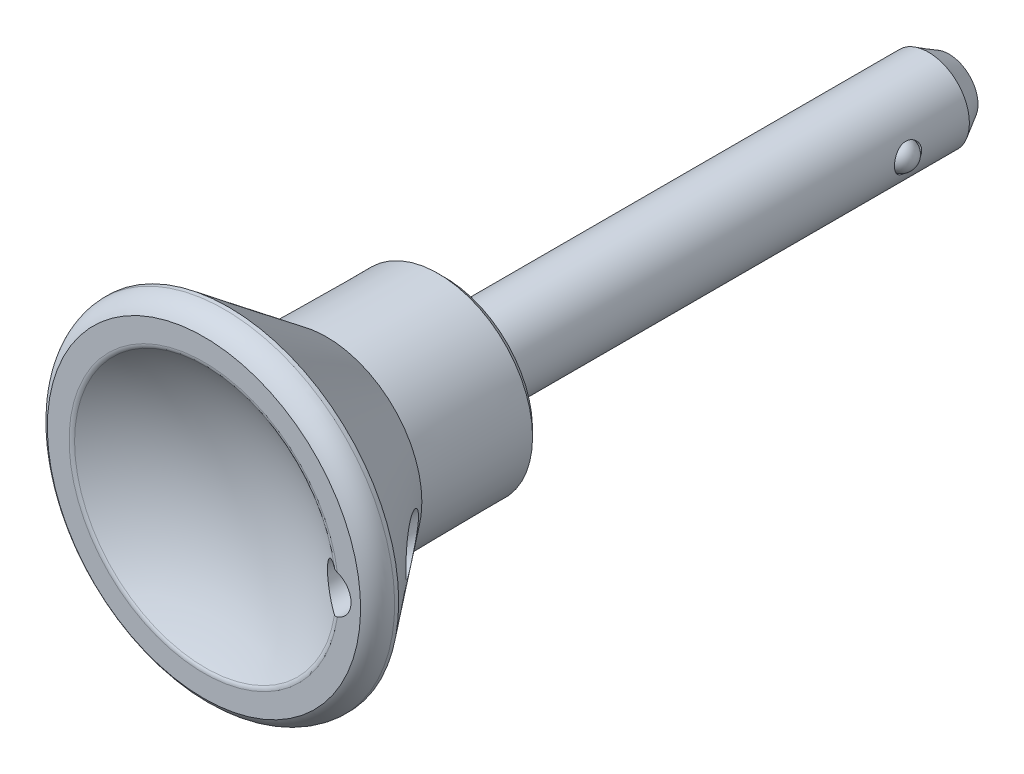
ISO-10303-21;
HEADER;
FILE_DESCRIPTION(('STEP AP214'),'2;1');
FILE_NAME('part.step','',(''),(''),'','','');
FILE_SCHEMA(('AUTOMOTIVE_DESIGN { 1 0 10303 214 1 1 1 1 }'));
ENDSEC;
DATA;
#1=APPLICATION_CONTEXT('core data for automotive mechanical design processes');
#2=APPLICATION_PROTOCOL_DEFINITION('international standard','automotive_design',2000,#1);
#3=PRODUCT_CONTEXT('',#1,'mechanical');
#4=PRODUCT('Part','Part','',(#3));
#5=PRODUCT_RELATED_PRODUCT_CATEGORY('part','',(#4));
#6=PRODUCT_DEFINITION_FORMATION('','',#4);
#7=PRODUCT_DEFINITION_CONTEXT('part definition',#1,'design');
#8=PRODUCT_DEFINITION('design','',#6,#7);
#9=PRODUCT_DEFINITION_SHAPE('','',#8);
#10=(LENGTH_UNIT() NAMED_UNIT(*) SI_UNIT(.MILLI.,.METRE.));
#11=(NAMED_UNIT(*) PLANE_ANGLE_UNIT() SI_UNIT($,.RADIAN.));
#12=(NAMED_UNIT(*) SI_UNIT($,.STERADIAN.) SOLID_ANGLE_UNIT());
#13=UNCERTAINTY_MEASURE_WITH_UNIT(LENGTH_MEASURE(1.E-05),#10,'distance_accuracy_value','');
#14=(GEOMETRIC_REPRESENTATION_CONTEXT(3) GLOBAL_UNCERTAINTY_ASSIGNED_CONTEXT((#13)) GLOBAL_UNIT_ASSIGNED_CONTEXT((#10,
#11,#12)) REPRESENTATION_CONTEXT('',''));
#15=CARTESIAN_POINT('',(0.,0.,0.));
#16=DIRECTION('',(0.,0.,1.));
#17=DIRECTION('',(1.,0.,0.));
#18=AXIS2_PLACEMENT_3D('',#15,#16,#17);
#19=CARTESIAN_POINT('',(0.,0.,0.));
#20=DIRECTION('',(0.,0.,1.));
#21=DIRECTION('',(0.,-1.,0.));
#22=AXIS2_PLACEMENT_3D('',#19,#20,#21);
#23=CYLINDRICAL_SURFACE('',#22,3.);
#24=CARTESIAN_POINT('',(0.,0.,0.));
#25=DIRECTION('',(0.,0.,1.));
#26=DIRECTION('',(0.,-1.,0.));
#27=AXIS2_PLACEMENT_3D('',#24,#25,#26);
#28=CIRCLE('',#27,3.);
#29=CARTESIAN_POINT('',(0.,-3.,0.));
#30=VERTEX_POINT('',#29);
#31=EDGE_CURVE('E18',#30,#30,#28,.T.);
#32=ORIENTED_EDGE('',*,*,#31,.F.);
#33=EDGE_LOOP('',(#32));
#34=FACE_BOUND('',#33,.T.);
#35=CARTESIAN_POINT('',(0.,0.,-35.5));
#36=DIRECTION('',(0.,0.,1.));
#37=DIRECTION('',(1.,0.,0.));
#38=AXIS2_PLACEMENT_3D('',#35,#36,#37);
#39=CIRCLE('',#38,3.);
#40=CARTESIAN_POINT('',(3.,0.,-35.5));
#41=VERTEX_POINT('',#40);
#42=EDGE_CURVE('E115',#41,#41,#39,.T.);
#43=ORIENTED_EDGE('',*,*,#42,.T.);
#44=EDGE_LOOP('',(#43));
#45=FACE_BOUND('',#44,.T.);
#46=CARTESIAN_POINT('',(3.,0.,-32.));
#47=CARTESIAN_POINT('',(2.99999782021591,-0.0544873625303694,-31.9999969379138));
#48=CARTESIAN_POINT('',(2.99849945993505,-0.109030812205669,-31.9955259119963));
#49=CARTESIAN_POINT('',(2.99265949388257,-0.216567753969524,-31.9777925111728));
#50=CARTESIAN_POINT('',(2.98831315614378,-0.269558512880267,-31.9645155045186));
#51=CARTESIAN_POINT('',(2.9772520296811,-0.372338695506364,-31.9296777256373));
#52=CARTESIAN_POINT('',(2.97054267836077,-0.422135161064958,-31.9081359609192));
#53=CARTESIAN_POINT('',(2.95544181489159,-0.517390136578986,-31.8574495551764));
#54=CARTESIAN_POINT('',(2.94705050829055,-0.562849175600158,-31.8283058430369));
#55=CARTESIAN_POINT('',(2.9291411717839,-0.649740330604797,-31.7621750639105));
#56=CARTESIAN_POINT('',(2.91959606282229,-0.691001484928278,-31.7249707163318));
#57=CARTESIAN_POINT('',(2.90060364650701,-0.766830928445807,-31.6442351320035));
#58=CARTESIAN_POINT('',(2.89115636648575,-0.80139739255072,-31.6007021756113));
#59=CARTESIAN_POINT('',(2.87313330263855,-0.863825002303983,-31.5070147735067));
#60=CARTESIAN_POINT('',(2.86459035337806,-0.891464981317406,-31.4567060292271));
#61=CARTESIAN_POINT('',(2.84975302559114,-0.937818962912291,-31.3518236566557));
#62=CARTESIAN_POINT('',(2.84345795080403,-0.956535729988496,-31.2972513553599));
#63=CARTESIAN_POINT('',(2.834113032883,-0.983873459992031,-31.187326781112));
#64=CARTESIAN_POINT('',(2.83096095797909,-0.992813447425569,-31.1320627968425));
#65=CARTESIAN_POINT('',(2.82795656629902,-1.00134112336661,-31.020736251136));
#66=CARTESIAN_POINT('',(2.82810323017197,-1.00093170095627,-30.9646739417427));
#67=CARTESIAN_POINT('',(2.83159014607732,-0.991019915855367,-30.8560634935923));
#68=CARTESIAN_POINT('',(2.83478414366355,-0.981933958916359,-30.8034718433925));
#69=CARTESIAN_POINT('',(2.84376655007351,-0.955606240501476,-30.7006068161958));
#70=CARTESIAN_POINT('',(2.84955528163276,-0.938363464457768,-30.650333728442));
#71=CARTESIAN_POINT('',(2.86317929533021,-0.895938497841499,-30.5525859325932));
#72=CARTESIAN_POINT('',(2.87104608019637,-0.870632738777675,-30.5051694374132));
#73=CARTESIAN_POINT('',(2.88792606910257,-0.812887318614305,-30.4151267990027));
#74=CARTESIAN_POINT('',(2.89693954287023,-0.780445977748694,-30.3725017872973));
#75=CARTESIAN_POINT('',(2.91567165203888,-0.707355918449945,-30.2909155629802));
#76=CARTESIAN_POINT('',(2.92540257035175,-0.666367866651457,-30.2522605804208));
#77=CARTESIAN_POINT('',(2.94406631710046,-0.578354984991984,-30.1822794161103));
#78=CARTESIAN_POINT('',(2.95299879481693,-0.531327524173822,-30.1509564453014));
#79=CARTESIAN_POINT('',(2.96917806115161,-0.431907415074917,-30.0962803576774));
#80=CARTESIAN_POINT('',(2.97640595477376,-0.37946312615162,-30.073015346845));
#81=CARTESIAN_POINT('',(2.98821351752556,-0.271163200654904,-30.0357719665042));
#82=CARTESIAN_POINT('',(2.99279860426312,-0.215314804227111,-30.0217745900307));
#83=CARTESIAN_POINT('',(2.99719039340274,-0.132457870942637,-30.0084544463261));
#84=CARTESIAN_POINT('',(2.99824082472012,-0.106081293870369,-30.0052879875));
#85=CARTESIAN_POINT('',(2.9996461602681,-0.0531409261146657,-30.0010600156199));
#86=CARTESIAN_POINT('',(3.00000106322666,-0.0265771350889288,-29.9999985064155));
#87=CARTESIAN_POINT('',(2.99999782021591,0.0544873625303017,-30.0000030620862));
#88=CARTESIAN_POINT('',(2.99849945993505,0.109030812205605,-30.0044740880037));
#89=CARTESIAN_POINT('',(2.99265949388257,0.216567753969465,-30.0222074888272));
#90=CARTESIAN_POINT('',(2.98831315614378,0.26955851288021,-30.0354844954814));
#91=CARTESIAN_POINT('',(2.9772520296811,0.372338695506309,-30.0703222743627));
#92=CARTESIAN_POINT('',(2.97054267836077,0.422135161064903,-30.0918640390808));
#93=CARTESIAN_POINT('',(2.95544181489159,0.517390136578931,-30.1425504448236));
#94=CARTESIAN_POINT('',(2.94705050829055,0.562849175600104,-30.1716941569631));
#95=CARTESIAN_POINT('',(2.9291411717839,0.649740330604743,-30.2378249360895));
#96=CARTESIAN_POINT('',(2.91959606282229,0.691001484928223,-30.2750292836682));
#97=CARTESIAN_POINT('',(2.90060364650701,0.766830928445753,-30.3557648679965));
#98=CARTESIAN_POINT('',(2.89115636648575,0.801397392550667,-30.3992978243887));
#99=CARTESIAN_POINT('',(2.87313330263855,0.86382500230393,-30.4929852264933));
#100=CARTESIAN_POINT('',(2.86459035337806,0.891464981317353,-30.5432939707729));
#101=CARTESIAN_POINT('',(2.84975302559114,0.937818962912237,-30.6481763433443));
#102=CARTESIAN_POINT('',(2.84345795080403,0.956535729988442,-30.7027486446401));
#103=CARTESIAN_POINT('',(2.834113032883,0.983873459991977,-30.812673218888));
#104=CARTESIAN_POINT('',(2.83096095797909,0.992813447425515,-30.8679372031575));
#105=CARTESIAN_POINT('',(2.82795656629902,1.00134112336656,-30.979263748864));
#106=CARTESIAN_POINT('',(2.82810323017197,1.00093170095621,-31.0353260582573));
#107=CARTESIAN_POINT('',(2.83159014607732,0.991019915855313,-31.1439365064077));
#108=CARTESIAN_POINT('',(2.83478414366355,0.981933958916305,-31.1965281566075));
#109=CARTESIAN_POINT('',(2.84376655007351,0.955606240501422,-31.2993931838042));
#110=CARTESIAN_POINT('',(2.84955528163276,0.938363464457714,-31.349666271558));
#111=CARTESIAN_POINT('',(2.86317929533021,0.895938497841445,-31.4474140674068));
#112=CARTESIAN_POINT('',(2.87104608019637,0.870632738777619,-31.4948305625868));
#113=CARTESIAN_POINT('',(2.88792606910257,0.81288731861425,-31.5848732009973));
#114=CARTESIAN_POINT('',(2.89693954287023,0.780445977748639,-31.6274982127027));
#115=CARTESIAN_POINT('',(2.91567165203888,0.70735591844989,-31.7090844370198));
#116=CARTESIAN_POINT('',(2.92540257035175,0.6663678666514,-31.7477394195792));
#117=CARTESIAN_POINT('',(2.94406631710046,0.578354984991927,-31.8177205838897));
#118=CARTESIAN_POINT('',(2.95299879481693,0.531327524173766,-31.8490435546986));
#119=CARTESIAN_POINT('',(2.96917806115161,0.431907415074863,-31.9037196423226));
#120=CARTESIAN_POINT('',(2.97640595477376,0.379463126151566,-31.926984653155));
#121=CARTESIAN_POINT('',(2.98821351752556,0.27116320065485,-31.9642280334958));
#122=CARTESIAN_POINT('',(2.99279860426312,0.215314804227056,-31.9782254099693));
#123=CARTESIAN_POINT('',(2.99719039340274,0.132457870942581,-31.9915455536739));
#124=CARTESIAN_POINT('',(2.99824082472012,0.10608129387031,-31.9947120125));
#125=CARTESIAN_POINT('',(2.9996461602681,0.0531409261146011,-31.9989399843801));
#126=CARTESIAN_POINT('',(3.00000106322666,0.0265771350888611,-32.0000014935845));
#127=CARTESIAN_POINT('',(3.,0.,-32.));
#128=B_SPLINE_CURVE_WITH_KNOTS('',3,(#46,#47,#48,#49,#50,#51,#52,#53,#54,#55,#56,#57,#58,#59,
#60,#61,#62,#63,#64,#65,#66,#67,#68,#69,#70,#71,#72,#73,#74,#75,#76,#77,#78,#79,#80,#81,#82,#83,
#84,#85,#86,#87,#88,#89,#90,#91,#92,#93,#94,#95,#96,#97,#98,#99,#100,#101,#102,#103,#104,#105,
#106,#107,#108,#109,#110,#111,#112,#113,#114,#115,#116,#117,#118,#119,#120,#121,#122,#123,#124,
#125,#126,#127),.UNSPECIFIED.,.T.,.F.,(4,2,2,2,2,2,2,2,2,2,2,2,2,2,2,2,2,2,2,2,2,2,2,2,2,2,2,2,
2,2,2,2,2,2,2,2,2,2,2,2,4),(0.,0.163359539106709,0.326991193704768,0.490248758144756,
0.653486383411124,0.821842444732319,0.990244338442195,1.16348424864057,1.3366704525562,
1.50401925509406,1.67131634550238,1.83096789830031,1.99063931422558,2.15288605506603,
2.31517103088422,2.4859039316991,2.6567114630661,2.82933165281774,3.00159671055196,
3.08127795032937,3.16095933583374,3.32431887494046,3.48795052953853,3.65120809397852,
3.81444571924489,3.98280178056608,4.15120367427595,4.32444358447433,4.49762978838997,
4.66497859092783,4.83227568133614,4.99192723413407,5.15159865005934,5.3138453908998,
5.47613036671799,5.64686326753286,5.81767079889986,5.9902909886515,6.16255604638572,
6.24223728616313,6.32191867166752),.UNSPECIFIED.);
#129=CARTESIAN_POINT('',(3.,0.,-32.));
#130=VERTEX_POINT('',#129);
#131=EDGE_CURVE('E159',#130,#130,#128,.T.);
#132=ORIENTED_EDGE('',*,*,#131,.T.);
#133=EDGE_LOOP('',(#132));
#134=FACE_BOUND('',#133,.T.);
#135=ADVANCED_FACE('F15',(#34,#45,#134),#23,.T.);
#136=CARTESIAN_POINT('',(6.4240762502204,-6.50116727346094,0.));
#137=DIRECTION('',(0.,0.,-1.));
#138=DIRECTION('',(-1.,0.,0.));
#139=AXIS2_PLACEMENT_3D('',#136,#137,#138);
#140=PLANE('',#139);
#141=ORIENTED_EDGE('',*,*,#31,.T.);
#142=EDGE_LOOP('',(#141));
#143=FACE_BOUND('',#142,.T.);
#144=CARTESIAN_POINT('',(0.,0.,0.));
#145=DIRECTION('',(0.,0.,1.));
#146=DIRECTION('',(0.,-1.,0.));
#147=AXIS2_PLACEMENT_3D('',#144,#145,#146);
#148=CIRCLE('',#147,6.4240762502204);
#149=CARTESIAN_POINT('',(0.,-6.4240762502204,0.));
#150=VERTEX_POINT('',#149);
#151=EDGE_CURVE('E103',#150,#150,#148,.T.);
#152=ORIENTED_EDGE('',*,*,#151,.F.);
#153=EDGE_LOOP('',(#152));
#154=FACE_BOUND('',#153,.T.);
#155=ADVANCED_FACE('F184',(#143,#154),#140,.T.);
#156=CARTESIAN_POINT('',(0.,0.,0.));
#157=DIRECTION('',(0.,0.,1.));
#158=DIRECTION('',(0.,-1.,0.));
#159=AXIS2_PLACEMENT_3D('',#156,#157,#158);
#160=CONICAL_SURFACE('',#159,6.4240762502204,0.789761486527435);
#161=CARTESIAN_POINT('',(0.,0.,0.499980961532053));
#162=DIRECTION('',(0.,0.,-1.));
#163=DIRECTION('',(1.,0.,0.));
#164=AXIS2_PLACEMENT_3D('',#161,#162,#163);
#165=CIRCLE('',#164,6.92843951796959);
#166=CARTESIAN_POINT('',(6.92843951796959,0.,0.499980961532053));
#167=VERTEX_POINT('',#166);
#168=EDGE_CURVE('E134',#167,#167,#165,.F.);
#169=ORIENTED_EDGE('',*,*,#168,.F.);
#170=EDGE_LOOP('',(#169));
#171=FACE_BOUND('',#170,.T.);
#172=ORIENTED_EDGE('',*,*,#151,.T.);
#173=EDGE_LOOP('',(#172));
#174=FACE_BOUND('',#173,.T.);
#175=ADVANCED_FACE('F189',(#171,#174),#160,.T.);
#176=CARTESIAN_POINT('',(0.,0.,0.499980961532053));
#177=DIRECTION('',(0.,0.,1.));
#178=DIRECTION('',(0.,-1.,0.));
#179=AXIS2_PLACEMENT_3D('',#176,#177,#178);
#180=CONICAL_SURFACE('',#179,6.92843951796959,0.00872664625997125);
#181=CARTESIAN_POINT('',(0.,0.,8.7));
#182=DIRECTION('',(0.,0.,-1.));
#183=DIRECTION('',(1.,0.,0.));
#184=AXIS2_PLACEMENT_3D('',#181,#182,#183);
#185=CIRCLE('',#184,7.);
#186=CARTESIAN_POINT('',(7.,0.,8.7));
#187=VERTEX_POINT('',#186);
#188=EDGE_CURVE('E129',#187,#187,#185,.F.);
#189=ORIENTED_EDGE('',*,*,#188,.F.);
#190=EDGE_LOOP('',(#189));
#191=FACE_BOUND('',#190,.T.);
#192=ORIENTED_EDGE('',*,*,#168,.T.);
#193=EDGE_LOOP('',(#192));
#194=FACE_BOUND('',#193,.T.);
#195=ADVANCED_FACE('F201',(#191,#194),#180,.T.);
#196=CARTESIAN_POINT('',(0.,0.,16.2));
#197=DIRECTION('',(0.,0.,1.));
#198=DIRECTION('',(0.,-1.,0.));
#199=AXIS2_PLACEMENT_3D('',#196,#197,#198);
#200=CYLINDRICAL_SURFACE('',#199,12.5);
#201=CARTESIAN_POINT('',(0.,0.,15.9));
#202=DIRECTION('',(0.,0.,-1.));
#203=DIRECTION('',(1.,0.,0.));
#204=AXIS2_PLACEMENT_3D('',#201,#202,#203);
#205=CIRCLE('',#204,12.5);
#206=CARTESIAN_POINT('',(12.5,0.,15.9));
#207=VERTEX_POINT('',#206);
#208=EDGE_CURVE('E130',#207,#207,#205,.T.);
#209=ORIENTED_EDGE('',*,*,#208,.F.);
#210=EDGE_LOOP('',(#209));
#211=FACE_BOUND('',#210,.T.);
#212=CARTESIAN_POINT('',(0.,0.,16.2));
#213=DIRECTION('',(0.,0.,1.));
#214=DIRECTION('',(0.,-1.,0.));
#215=AXIS2_PLACEMENT_3D('',#212,#213,#214);
#216=CIRCLE('',#215,12.5);
#217=CARTESIAN_POINT('',(0.,-12.5,16.2));
#218=VERTEX_POINT('',#217);
#219=EDGE_CURVE('E102',#218,#218,#216,.T.);
#220=ORIENTED_EDGE('',*,*,#219,.F.);
#221=EDGE_LOOP('',(#220));
#222=FACE_BOUND('',#221,.T.);
#223=ADVANCED_FACE('F208',(#211,#222),#200,.T.);
#224=CARTESIAN_POINT('',(0.,0.,8.7));
#225=DIRECTION('',(0.,0.,1.));
#226=DIRECTION('',(0.,-1.,0.));
#227=AXIS2_PLACEMENT_3D('',#224,#225,#226);
#228=CONICAL_SURFACE('',#227,7.,0.65233090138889);
#229=CARTESIAN_POINT('',(9.05806451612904,-1.4803605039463,11.5515077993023));
#230=CARTESIAN_POINT('',(8.99141512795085,-1.46946825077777,11.4631001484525));
#231=CARTESIAN_POINT('',(8.92550148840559,-1.45408557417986,11.3746905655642));
#232=CARTESIAN_POINT('',(8.7955636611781,-1.41427171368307,11.1984472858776));
#233=CARTESIAN_POINT('',(8.73154031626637,-1.38983655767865,11.1106138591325));
#234=CARTESIAN_POINT('',(8.60623315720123,-1.33170423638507,10.936758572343));
#235=CARTESIAN_POINT('',(8.54493725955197,-1.29805393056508,10.8507298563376));
#236=CARTESIAN_POINT('',(8.42544336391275,-1.22074353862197,10.6811358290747));
#237=CARTESIAN_POINT('',(8.36724184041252,-1.17709515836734,10.5975677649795));
#238=CARTESIAN_POINT('',(8.26922940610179,-1.09114708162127,10.4552980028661));
#239=CARTESIAN_POINT('',(8.22852162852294,-1.05135683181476,10.3957022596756));
#240=CARTESIAN_POINT('',(8.14989980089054,-0.964725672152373,10.2796936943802));
#241=CARTESIAN_POINT('',(8.11198828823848,-0.917878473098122,10.2232837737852));
#242=CARTESIAN_POINT('',(8.03963417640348,-0.815744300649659,10.1148327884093));
#243=CARTESIAN_POINT('',(8.00522654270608,-0.760383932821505,10.0628364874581));
#244=CARTESIAN_POINT('',(7.94192848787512,-0.640477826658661,9.96655825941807));
#245=CARTESIAN_POINT('',(7.91302454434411,-0.575955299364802,9.92225744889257));
#246=CARTESIAN_POINT('',(7.87251252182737,-0.463057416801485,9.85986137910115));
#247=CARTESIAN_POINT('',(7.85846623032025,-0.417573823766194,9.8381417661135));
#248=CARTESIAN_POINT('',(7.83441768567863,-0.3231529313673,9.80086955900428));
#249=CARTESIAN_POINT('',(7.82440740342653,-0.274222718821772,9.78530472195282));
#250=CARTESIAN_POINT('',(7.81132335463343,-0.187620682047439,9.76493500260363));
#251=CARTESIAN_POINT('',(7.80710048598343,-0.15053785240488,9.7583503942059));
#252=CARTESIAN_POINT('',(7.80143783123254,-0.0756412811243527,9.74951765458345));
#253=CARTESIAN_POINT('',(7.79999798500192,-0.0378275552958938,9.74726942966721));
#254=CARTESIAN_POINT('',(7.8000025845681,0.0485200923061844,9.74727695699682));
#255=CARTESIAN_POINT('',(7.80237736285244,0.0970629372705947,9.75098545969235));
#256=CARTESIAN_POINT('',(7.81164444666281,0.192651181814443,9.76543406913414));
#257=CARTESIAN_POINT('',(7.81854204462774,0.239694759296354,9.77618241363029));
#258=CARTESIAN_POINT('',(7.83829683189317,0.341610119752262,9.80688772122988));
#259=CARTESIAN_POINT('',(7.85215507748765,0.395817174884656,9.82838678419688));
#260=CARTESIAN_POINT('',(7.8845198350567,0.499375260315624,9.87838349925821));
#261=CARTESIAN_POINT('',(7.90303499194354,0.548717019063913,9.9068941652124));
#262=CARTESIAN_POINT('',(7.95423062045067,0.667068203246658,9.98533549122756));
#263=CARTESIAN_POINT('',(7.98924354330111,0.732796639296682,10.0386516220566));
#264=CARTESIAN_POINT('',(8.06472209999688,0.853932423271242,10.1525776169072));
#265=CARTESIAN_POINT('',(8.10520064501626,0.909314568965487,10.2132047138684));
#266=CARTESIAN_POINT('',(8.18383548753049,1.00367842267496,10.3298982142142));
#267=CARTESIAN_POINT('',(8.22147534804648,1.04387385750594,10.3853483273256));
#268=CARTESIAN_POINT('',(8.29898008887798,1.1184153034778,10.4986148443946));
#269=CARTESIAN_POINT('',(8.33884646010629,1.15275733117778,10.556432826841));
#270=CARTESIAN_POINT('',(8.42042546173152,1.21614962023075,10.6737908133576));
#271=CARTESIAN_POINT('',(8.46214099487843,1.24519116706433,10.7333334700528));
#272=CARTESIAN_POINT('',(8.54706483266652,1.29830522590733,10.8535675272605));
#273=CARTESIAN_POINT('',(8.59027353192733,1.32237641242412,10.9142592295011));
#274=CARTESIAN_POINT('',(8.69675324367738,1.37513054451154,11.0626135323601));
#275=CARTESIAN_POINT('',(8.7606819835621,1.40136483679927,11.150681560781));
#276=CARTESIAN_POINT('',(8.89058399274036,1.44466814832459,11.3275915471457));
#277=CARTESIAN_POINT('',(8.95655819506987,1.46173291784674,11.4164338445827));
#278=CARTESIAN_POINT('',(9.09008194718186,1.48679092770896,11.5942301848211));
#279=CARTESIAN_POINT('',(9.15763151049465,1.49478409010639,11.683184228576));
#280=CARTESIAN_POINT('',(9.293788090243,1.50153429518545,11.8605390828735));
#281=CARTESIAN_POINT('',(9.36239469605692,1.50029483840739,11.9489400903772));
#282=CARTESIAN_POINT('',(9.53896432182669,1.48478544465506,12.1740527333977));
#283=CARTESIAN_POINT('',(9.64741582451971,1.46359594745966,12.3100469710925));
#284=CARTESIAN_POINT('',(9.80896256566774,1.41213790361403,12.5095339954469));
#285=CARTESIAN_POINT('',(9.86259038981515,1.39172486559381,12.5752398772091));
#286=CARTESIAN_POINT('',(9.96902195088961,1.34380635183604,12.7046889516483));
#287=CARTESIAN_POINT('',(10.021826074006,1.31630431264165,12.7684330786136));
#288=CARTESIAN_POINT('',(10.1398540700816,1.24522266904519,12.9099256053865));
#289=CARTESIAN_POINT('',(10.2046458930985,1.1993124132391,12.9868895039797));
#290=CARTESIAN_POINT('',(10.3299573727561,1.09357010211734,13.1345591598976));
#291=CARTESIAN_POINT('',(10.3904821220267,1.03375502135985,13.2052724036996));
#292=CARTESIAN_POINT('',(10.4895745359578,0.916081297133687,13.3202576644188));
#293=CARTESIAN_POINT('',(10.5297805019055,0.861692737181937,13.3666468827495));
#294=CARTESIAN_POINT('',(10.6043536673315,0.743973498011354,13.452316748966));
#295=CARTESIAN_POINT('',(10.6387288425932,0.680655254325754,13.4916071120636));
#296=CARTESIAN_POINT('',(10.6925693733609,0.560424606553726,13.5529446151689));
#297=CARTESIAN_POINT('',(10.7136506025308,0.505208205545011,13.5768833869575));
#298=CARTESIAN_POINT('',(10.7495749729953,0.39030246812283,13.6176027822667));
#299=CARTESIAN_POINT('',(10.7644289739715,0.330621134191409,13.6343958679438));
#300=CARTESIAN_POINT('',(10.7836092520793,0.225596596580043,13.656059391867));
#301=CARTESIAN_POINT('',(10.7897268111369,0.180990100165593,13.6629607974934));
#302=CARTESIAN_POINT('',(10.7979243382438,0.0909301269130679,13.6722061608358));
#303=CARTESIAN_POINT('',(10.8000037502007,0.0454765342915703,13.6745494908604));
#304=CARTESIAN_POINT('',(10.799994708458,-0.0641674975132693,13.6745397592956));
#305=CARTESIAN_POINT('',(10.795841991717,-0.128380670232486,13.6698606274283));
#306=CARTESIAN_POINT('',(10.7796239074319,-0.254506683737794,13.6515601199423));
#307=CARTESIAN_POINT('',(10.7675483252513,-0.316416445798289,13.6379272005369));
#308=CARTESIAN_POINT('',(10.7366563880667,-0.435644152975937,13.6029693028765));
#309=CARTESIAN_POINT('',(10.7178919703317,-0.492993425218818,13.5817035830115));
#310=CARTESIAN_POINT('',(10.6748799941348,-0.602645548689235,13.532811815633));
#311=CARTESIAN_POINT('',(10.6506301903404,-0.654946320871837,13.5051831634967));
#312=CARTESIAN_POINT('',(10.5859735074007,-0.77647271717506,13.4312530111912));
#313=CARTESIAN_POINT('',(10.5432056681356,-0.842728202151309,13.3821425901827));
#314=CARTESIAN_POINT('',(10.4516580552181,-0.964099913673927,13.2763616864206));
#315=CARTESIAN_POINT('',(10.4028645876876,-1.01918998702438,13.2196739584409));
#316=CARTESIAN_POINT('',(10.2766029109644,-1.14345503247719,13.0719673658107));
#317=CARTESIAN_POINT('',(10.1967753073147,-1.20635475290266,12.9777102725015));
#318=CARTESIAN_POINT('',(10.0329696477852,-1.31236147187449,12.7820645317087));
#319=CARTESIAN_POINT('',(9.94898466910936,-1.35543413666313,12.6806638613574));
#320=CARTESIAN_POINT('',(9.79718248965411,-1.41705079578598,12.4951419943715));
#321=CARTESIAN_POINT('',(9.72964852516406,-1.43883766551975,12.4118303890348));
#322=CARTESIAN_POINT('',(9.59439459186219,-1.47247845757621,12.2433068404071));
#323=CARTESIAN_POINT('',(9.52667453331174,-1.48432617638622,12.1580937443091));
#324=CARTESIAN_POINT('',(9.39151350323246,-1.49875216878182,11.9862568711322));
#325=CARTESIAN_POINT('',(9.32407407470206,-1.50130123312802,11.8996295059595));
#326=CARTESIAN_POINT('',(9.19020636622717,-1.49747387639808,11.725837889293));
#327=CARTESIAN_POINT('',(9.12377782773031,-1.49109977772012,11.6386737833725));
#328=CARTESIAN_POINT('',(9.05806451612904,-1.4803605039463,11.5515077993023));
#329=B_SPLINE_CURVE_WITH_KNOTS('',3,(#229,#230,#231,#232,#233,#234,#235,#236,#237,#238,#239,
#240,#241,#242,#243,#244,#245,#246,#247,#248,#249,#250,#251,#252,#253,#254,#255,#256,#257,#258,
#259,#260,#261,#262,#263,#264,#265,#266,#267,#268,#269,#270,#271,#272,#273,#274,#275,#276,#277,
#278,#279,#280,#281,#282,#283,#284,#285,#286,#287,#288,#289,#290,#291,#292,#293,#294,#295,#296,
#297,#298,#299,#300,#301,#302,#303,#304,#305,#306,#307,#308,#309,#310,#311,#312,#313,#314,#315,
#316,#317,#318,#319,#320,#321,#322,#323,#324,#325,#326,#327,#328),.UNSPECIFIED.,.T.,.F.,(4,2,2,
2,2,2,2,2,2,2,2,2,2,2,2,2,2,2,2,2,2,2,2,2,2,2,2,2,2,2,2,2,2,2,2,2,2,2,2,2,2,2,2,2,2,2,2,2,2,4),
(0.,0.333658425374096,0.667463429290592,0.999601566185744,1.33135280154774,1.57826788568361,
1.82540433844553,2.07480511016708,2.32358497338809,2.48005639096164,2.63621497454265,
2.74958301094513,2.86294859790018,3.00835870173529,3.15393926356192,3.33275537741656,
3.51190592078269,3.78514778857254,4.05904679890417,4.2931693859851,4.52745067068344,
4.76211373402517,4.9968392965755,5.33221840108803,5.66775280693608,6.0032900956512,
6.33870017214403,6.86226215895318,7.12372139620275,7.38505412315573,7.71589293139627,
8.04632996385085,8.29159071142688,8.53651321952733,8.72709088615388,8.91733480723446,
9.0535973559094,9.18987866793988,9.3821719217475,9.57471358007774,9.76579164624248,
9.95694806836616,10.2340958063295,10.5118854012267,10.9254412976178,11.3397106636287,
11.6675345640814,11.995562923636,12.3246208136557,12.6535930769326),.UNSPECIFIED.);
#330=CARTESIAN_POINT('',(9.05806451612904,-1.4803605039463,11.5515077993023));
#331=VERTEX_POINT('',#330);
#332=EDGE_CURVE('E52',#331,#331,#329,.T.);
#333=ORIENTED_EDGE('',*,*,#332,.F.);
#334=EDGE_LOOP('',(#333));
#335=FACE_BOUND('',#334,.T.);
#336=ORIENTED_EDGE('',*,*,#208,.T.);
#337=EDGE_LOOP('',(#336));
#338=FACE_BOUND('',#337,.T.);
#339=ORIENTED_EDGE('',*,*,#188,.T.);
#340=EDGE_LOOP('',(#339));
#341=FACE_BOUND('',#340,.T.);
#342=ADVANCED_FACE('F211',(#335,#338,#341),#228,.T.);
#343=CARTESIAN_POINT('',(0.,0.,15.9596620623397));
#344=DIRECTION('',(0.,0.,1.));
#345=DIRECTION('',(0.,-1.,0.));
#346=AXIS2_PLACEMENT_3D('',#343,#344,#345);
#347=TOROIDAL_SURFACE('',#346,10.5144930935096,2.);
#348=ORIENTED_EDGE('',*,*,#219,.T.);
#349=EDGE_LOOP('',(#348));
#350=FACE_BOUND('',#349,.T.);
#351=CARTESIAN_POINT('',(0.,0.,17.7));
#352=DIRECTION('',(0.,0.,1.));
#353=DIRECTION('',(0.,-1.,0.));
#354=AXIS2_PLACEMENT_3D('',#351,#352,#353);
#355=CIRCLE('',#354,11.5);
#356=CARTESIAN_POINT('',(0.,-11.5,17.7));
#357=VERTEX_POINT('',#356);
#358=EDGE_CURVE('E57',#357,#357,#355,.T.);
#359=ORIENTED_EDGE('',*,*,#358,.F.);
#360=EDGE_LOOP('',(#359));
#361=FACE_BOUND('',#360,.T.);
#362=ADVANCED_FACE('F86',(#350,#361),#347,.T.);
#363=CARTESIAN_POINT('',(9.3,0.,9.7468824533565));
#364=DIRECTION('',(0.,0.,1.));
#365=DIRECTION('',(0.,-1.,0.));
#366=AXIS2_PLACEMENT_3D('',#363,#364,#365);
#367=CYLINDRICAL_SURFACE('',#366,1.5);
#368=ORIENTED_EDGE('',*,*,#332,.T.);
#369=EDGE_LOOP('',(#368));
#370=FACE_BOUND('',#369,.T.);
#371=CARTESIAN_POINT('',(9.79838709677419,-1.41478277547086,17.7));
#372=CARTESIAN_POINT('',(9.76967463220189,-1.42493393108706,17.7000278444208));
#373=CARTESIAN_POINT('',(9.74057958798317,-1.43416331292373,17.6978154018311));
#374=CARTESIAN_POINT('',(9.68339626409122,-1.45046247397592,17.688811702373));
#375=CARTESIAN_POINT('',(9.65530246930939,-1.45758512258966,17.6821493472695));
#376=CARTESIAN_POINT('',(9.60265119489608,-1.46937623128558,17.6649718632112));
#377=CARTESIAN_POINT('',(9.5780018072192,-1.47420693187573,17.6548534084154));
#378=CARTESIAN_POINT('',(9.52973678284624,-1.48251466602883,17.6305344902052));
#379=CARTESIAN_POINT('',(9.50616459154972,-1.48595330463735,17.6162348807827));
#380=CARTESIAN_POINT('',(9.48387096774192,-1.48868783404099,17.6));
#381=B_SPLINE_CURVE_WITH_KNOTS('',3,(#371,#372,#373,#374,#375,#376,#377,#378,#379,#380),
.UNSPECIFIED.,.F.,.F.,(4,2,2,2,4),(0.,0.0913475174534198,0.180157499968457,0.261045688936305,
0.344033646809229),.UNSPECIFIED.);
#382=CARTESIAN_POINT('',(9.79838709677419,-1.41478277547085,17.7));
#383=VERTEX_POINT('',#382);
#384=CARTESIAN_POINT('',(9.48387096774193,-1.48868783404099,17.6));
#385=VERTEX_POINT('',#384);
#386=EDGE_CURVE('E44',#383,#385,#381,.T.);
#387=ORIENTED_EDGE('',*,*,#386,.F.);
#388=CARTESIAN_POINT('',(9.3,0.,17.7));
#389=DIRECTION('',(0.,0.,1.));
#390=DIRECTION('',(0.,-1.,0.));
#391=AXIS2_PLACEMENT_3D('',#388,#389,#390);
#392=CIRCLE('',#391,1.5);
#393=CARTESIAN_POINT('',(9.79838709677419,1.41478277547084,17.7));
#394=VERTEX_POINT('',#393);
#395=EDGE_CURVE('E32',#394,#383,#392,.F.);
#396=ORIENTED_EDGE('',*,*,#395,.F.);
#397=CARTESIAN_POINT('',(9.79838709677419,1.41478277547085,17.7));
#398=CARTESIAN_POINT('',(9.76967463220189,1.42493393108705,17.7000278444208));
#399=CARTESIAN_POINT('',(9.74057958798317,1.43416331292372,17.6978154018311));
#400=CARTESIAN_POINT('',(9.68339626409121,1.45046247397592,17.688811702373));
#401=CARTESIAN_POINT('',(9.65530246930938,1.45758512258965,17.6821493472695));
#402=CARTESIAN_POINT('',(9.60265119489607,1.46937623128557,17.6649718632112));
#403=CARTESIAN_POINT('',(9.5780018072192,1.47420693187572,17.6548534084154));
#404=CARTESIAN_POINT('',(9.52973678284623,1.48251466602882,17.6305344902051));
#405=CARTESIAN_POINT('',(9.50616459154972,1.48595330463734,17.6162348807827));
#406=CARTESIAN_POINT('',(9.48387096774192,1.48868783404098,17.6));
#407=B_SPLINE_CURVE_WITH_KNOTS('',3,(#397,#398,#399,#400,#401,#402,#403,#404,#405,#406),
.UNSPECIFIED.,.F.,.F.,(4,2,2,2,4),(0.,0.0913475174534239,0.180157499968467,0.261045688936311,
0.34403364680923),.UNSPECIFIED.);
#408=CARTESIAN_POINT('',(9.48387096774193,1.48868783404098,17.6));
#409=VERTEX_POINT('',#408);
#410=EDGE_CURVE('E45',#394,#409,#407,.T.);
#411=ORIENTED_EDGE('',*,*,#410,.T.);
#412=CARTESIAN_POINT('',(9.48387096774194,-1.48868783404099,17.6));
#413=CARTESIAN_POINT('',(9.38181447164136,-1.5012604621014,17.5258231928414));
#414=CARTESIAN_POINT('',(9.27847034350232,-1.50339409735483,17.4514075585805));
#415=CARTESIAN_POINT('',(9.07150168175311,-1.48616897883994,17.3036113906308));
#416=CARTESIAN_POINT('',(8.96788247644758,-1.46662385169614,17.230245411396));
#417=CARTESIAN_POINT('',(8.76570217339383,-1.40554015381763,17.0882393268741));
#418=CARTESIAN_POINT('',(8.66709675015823,-1.36425592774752,17.0195547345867));
#419=CARTESIAN_POINT('',(8.47807170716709,-1.25938003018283,16.8888158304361));
#420=CARTESIAN_POINT('',(8.38761877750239,-1.19588484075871,16.8267343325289));
#421=CARTESIAN_POINT('',(8.24568836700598,-1.0697955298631,16.7298945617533));
#422=CARTESIAN_POINT('',(8.19079097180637,-1.01295594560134,16.692612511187));
#423=CARTESIAN_POINT('',(8.08925811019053,-0.889102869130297,16.6238983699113));
#424=CARTESIAN_POINT('',(8.04262373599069,-0.822088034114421,16.5924670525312));
#425=CARTESIAN_POINT('',(7.95961243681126,-0.678453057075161,16.5366671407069));
#426=CARTESIAN_POINT('',(7.9233211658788,-0.601759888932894,16.5123574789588));
#427=CARTESIAN_POINT('',(7.86387797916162,-0.441385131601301,16.4726071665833));
#428=CARTESIAN_POINT('',(7.84069382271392,-0.357721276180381,16.4571447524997));
#429=CARTESIAN_POINT('',(7.81665644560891,-0.227526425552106,16.4411240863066));
#430=CARTESIAN_POINT('',(7.81042627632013,-0.182354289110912,16.4369745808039));
#431=CARTESIAN_POINT('',(7.80209606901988,-0.0914654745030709,16.4314273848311));
#432=CARTESIAN_POINT('',(7.79999581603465,-0.0457488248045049,16.4300295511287));
#433=CARTESIAN_POINT('',(7.8000067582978,0.0738974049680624,16.4300365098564));
#434=CARTESIAN_POINT('',(7.80550430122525,0.147878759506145,16.4336949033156));
#435=CARTESIAN_POINT('',(7.82172596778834,0.257047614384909,16.4445026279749));
#436=CARTESIAN_POINT('',(7.82847272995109,0.293170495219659,16.4489987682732));
#437=CARTESIAN_POINT('',(7.84452794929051,0.364609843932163,16.4597055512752));
#438=CARTESIAN_POINT('',(7.85383787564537,0.399925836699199,16.4659171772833));
#439=CARTESIAN_POINT('',(7.88533418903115,0.503926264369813,16.4869492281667));
#440=CARTESIAN_POINT('',(7.91114789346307,0.571060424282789,16.5042071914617));
#441=CARTESIAN_POINT('',(7.97122958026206,0.699580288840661,16.5444764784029));
#442=CARTESIAN_POINT('',(8.00550445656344,0.760961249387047,16.5674924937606));
#443=CARTESIAN_POINT('',(8.06330229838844,0.849663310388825,16.6064232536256));
#444=CARTESIAN_POINT('',(8.08431449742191,0.879441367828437,16.6205962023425));
#445=CARTESIAN_POINT('',(8.12808579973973,0.936974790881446,16.6501700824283));
#446=CARTESIAN_POINT('',(8.15084283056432,0.964732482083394,16.6655695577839));
#447=CARTESIAN_POINT('',(8.22150377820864,1.04495101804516,16.7134720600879));
#448=CARTESIAN_POINT('',(8.27178709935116,1.09434151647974,16.7476721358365));
#449=CARTESIAN_POINT('',(8.38550726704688,1.19170689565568,16.8253434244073));
#450=CARTESIAN_POINT('',(8.44976642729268,1.2382209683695,16.8694253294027));
#451=CARTESIAN_POINT('',(8.58287694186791,1.31978473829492,16.961227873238));
#452=CARTESIAN_POINT('',(8.65173257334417,1.3548235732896,17.0089519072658));
#453=CARTESIAN_POINT('',(8.76337185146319,1.40144242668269,17.0867690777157));
#454=CARTESIAN_POINT('',(8.80522580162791,1.41674274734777,17.1160369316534));
#455=CARTESIAN_POINT('',(8.88962205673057,1.44344948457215,17.1752539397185));
#456=CARTESIAN_POINT('',(8.93216367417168,1.45485956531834,17.2052024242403));
#457=CARTESIAN_POINT('',(9.06048356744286,1.4833442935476,17.2958544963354));
#458=CARTESIAN_POINT('',(9.14699642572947,1.4946896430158,17.3573922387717));
#459=CARTESIAN_POINT('',(9.31725275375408,1.50223877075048,17.4793658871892));
#460=CARTESIAN_POINT('',(9.40099551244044,1.49891929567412,17.5397732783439));
#461=CARTESIAN_POINT('',(9.48387096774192,1.4886878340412,17.6));
#462=B_SPLINE_CURVE_WITH_KNOTS('',3,(#412,#413,#414,#415,#416,#417,#418,#419,#420,#421,#422,
#423,#424,#425,#426,#427,#428,#429,#430,#431,#432,#433,#434,#435,#436,#437,#438,#439,#440,#441,
#442,#443,#444,#445,#446,#447,#448,#449,#450,#451,#452,#453,#454,#455,#456,#457,#458,#459,#460,
#461),.UNSPECIFIED.,.F.,.F.,(4,2,2,2,2,2,2,2,2,2,2,2,2,2,2,2,2,2,2,2,2,2,2,2,4),(0.,
0.380173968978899,0.763641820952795,1.14271969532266,1.52017093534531,1.7812816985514,
2.04242694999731,2.30567583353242,2.5682743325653,2.70539664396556,2.84251181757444,
3.06399194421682,3.17494513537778,3.28596205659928,3.50680011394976,3.72781870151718,
3.84503226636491,3.96210870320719,4.19632161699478,4.4675973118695,4.73912905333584,
4.89893578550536,5.05859157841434,5.3777521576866,5.68661469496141),.UNSPECIFIED.);
#463=EDGE_CURVE('E50',#385,#409,#462,.T.);
#464=ORIENTED_EDGE('',*,*,#463,.F.);
#465=EDGE_LOOP('',(#387,#396,#411,#464));
#466=FACE_BOUND('',#465,.T.);
#467=ADVANCED_FACE('F48',(#370,#466),#367,.F.);
#468=CARTESIAN_POINT('',(0.,0.,30.4));
#469=DIRECTION('',(0.,-1.,0.));
#470=DIRECTION('',(0.,0.,1.));
#471=AXIS2_PLACEMENT_3D('',#468,#469,#470);
#472=SPHERICAL_SURFACE('',#471,16.);
#473=ORIENTED_EDGE('',*,*,#463,.T.);
#474=CARTESIAN_POINT('',(0.,0.,17.6));
#475=DIRECTION('',(0.,0.,1.));
#476=DIRECTION('',(0.,-1.,0.));
#477=AXIS2_PLACEMENT_3D('',#474,#475,#476);
#478=CIRCLE('',#477,9.6);
#479=EDGE_CURVE('E25',#385,#409,#478,.F.);
#480=ORIENTED_EDGE('',*,*,#479,.F.);
#481=EDGE_LOOP('',(#473,#480));
#482=FACE_BOUND('',#481,.T.);
#483=ADVANCED_FACE('F79',(#482),#472,.F.);
#484=CARTESIAN_POINT('',(-11.73,-11.4999999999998,17.7));
#485=CARTESIAN_POINT('',(-11.5,-11.4999999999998,17.7));
#486=CARTESIAN_POINT('',(11.5,-11.4999999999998,17.7));
#487=B_SPLINE_CURVE_WITH_KNOTS('',1,(#484,#485,#486),.UNSPECIFIED.,.F.,.F.,(2,1,2),(-0.01,0.,
1.),.UNSPECIFIED.);
#488=DIRECTION('',(0.,1.,0.));
#489=VECTOR('',#488,1.);
#490=SURFACE_OF_LINEAR_EXTRUSION('',#487,#489);
#491=ORIENTED_EDGE('',*,*,#395,.T.);
#492=CARTESIAN_POINT('',(0.,0.,17.7));
#493=DIRECTION('',(0.,0.,1.));
#494=DIRECTION('',(0.,-1.,0.));
#495=AXIS2_PLACEMENT_3D('',#492,#493,#494);
#496=CIRCLE('',#495,9.9);
#497=EDGE_CURVE('E9',#394,#383,#496,.T.);
#498=ORIENTED_EDGE('',*,*,#497,.F.);
#499=EDGE_LOOP('',(#491,#498));
#500=FACE_BOUND('',#499,.T.);
#501=ORIENTED_EDGE('',*,*,#358,.T.);
#502=EDGE_LOOP('',(#501));
#503=FACE_BOUND('',#502,.T.);
#504=ADVANCED_FACE('F54',(#500,#503),#490,.T.);
#505=CARTESIAN_POINT('',(0.,0.,17.2));
#506=DIRECTION('',(0.,0.,1.));
#507=DIRECTION('',(0.,-1.,0.));
#508=AXIS2_PLACEMENT_3D('',#505,#506,#507);
#509=TOROIDAL_SURFACE('',#508,9.89999999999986,0.50000000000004);
#510=ORIENTED_EDGE('',*,*,#410,.F.);
#511=ORIENTED_EDGE('',*,*,#497,.T.);
#512=ORIENTED_EDGE('',*,*,#386,.T.);
#513=ORIENTED_EDGE('',*,*,#479,.T.);
#514=EDGE_LOOP('',(#510,#511,#512,#513));
#515=FACE_BOUND('',#514,.T.);
#516=ADVANCED_FACE('F42',(#515),#509,.T.);
#517=CARTESIAN_POINT('',(2.49,0.,-31.));
#518=DIRECTION('',(0.,-1.,0.));
#519=DIRECTION('',(0.,0.,-1.));
#520=AXIS2_PLACEMENT_3D('',#517,#518,#519);
#521=SPHERICAL_SURFACE('',#520,1.01);
#522=CARTESIAN_POINT('',(2.63177446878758,0.,-31.));
#523=DIRECTION('',(1.,0.,0.));
#524=DIRECTION('',(0.,-1.,0.));
#525=AXIS2_PLACEMENT_3D('',#522,#523,#524);
#526=CIRCLE('',#525,1.);
#527=CARTESIAN_POINT('',(2.63177446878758,-1.00000000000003,-31.));
#528=VERTEX_POINT('',#527);
#529=EDGE_CURVE('E148',#528,#528,#526,.F.);
#530=ORIENTED_EDGE('',*,*,#529,.F.);
#531=EDGE_LOOP('',(#530));
#532=FACE_BOUND('',#531,.T.);
#533=ADVANCED_FACE('F108',(#532),#521,.T.);
#534=CARTESIAN_POINT('',(2.13397459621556,-2.15958441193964,-37.));
#535=DIRECTION('',(0.,0.,-1.));
#536=DIRECTION('',(-1.,0.,0.));
#537=AXIS2_PLACEMENT_3D('',#534,#535,#536);
#538=PLANE('',#537);
#539=CARTESIAN_POINT('',(0.,0.,-37.));
#540=DIRECTION('',(0.,0.,1.));
#541=DIRECTION('',(0.,-1.,0.));
#542=AXIS2_PLACEMENT_3D('',#539,#540,#541);
#543=CIRCLE('',#542,2.13397459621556);
#544=CARTESIAN_POINT('',(0.,-2.13397459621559,-37.));
#545=VERTEX_POINT('',#544);
#546=EDGE_CURVE('E153',#545,#545,#543,.T.);
#547=ORIENTED_EDGE('',*,*,#546,.F.);
#548=EDGE_LOOP('',(#547));
#549=FACE_BOUND('',#548,.T.);
#550=ADVANCED_FACE('F174',(#549),#538,.T.);
#551=CARTESIAN_POINT('',(2.63177446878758,0.,-31.));
#552=DIRECTION('',(1.,0.,0.));
#553=DIRECTION('',(0.,-1.,0.));
#554=AXIS2_PLACEMENT_3D('',#551,#552,#553);
#555=CYLINDRICAL_SURFACE('',#554,1.);
#556=ORIENTED_EDGE('',*,*,#529,.T.);
#557=EDGE_LOOP('',(#556));
#558=FACE_BOUND('',#557,.T.);
#559=ORIENTED_EDGE('',*,*,#131,.F.);
#560=EDGE_LOOP('',(#559));
#561=FACE_BOUND('',#560,.T.);
#562=ADVANCED_FACE('F169',(#558,#561),#555,.F.);
#563=CARTESIAN_POINT('',(0.,0.,-37.));
#564=DIRECTION('',(0.,0.,1.));
#565=DIRECTION('',(0.,-1.,0.));
#566=AXIS2_PLACEMENT_3D('',#563,#564,#565);
#567=CONICAL_SURFACE('',#566,2.13397459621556,0.523598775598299);
#568=ORIENTED_EDGE('',*,*,#42,.F.);
#569=EDGE_LOOP('',(#568));
#570=FACE_BOUND('',#569,.T.);
#571=ORIENTED_EDGE('',*,*,#546,.T.);
#572=EDGE_LOOP('',(#571));
#573=FACE_BOUND('',#572,.T.);
#574=ADVANCED_FACE('F173',(#570,#573),#567,.T.);
#575=CLOSED_SHELL('',(#135,#155,#175,#195,#223,#342,#362,#467,#483,#504,#516,#533,#550,#562,#574));
#576=MANIFOLD_SOLID_BREP('B1',#575);
#577=ADVANCED_BREP_SHAPE_REPRESENTATION('',(#18,#576),#14);
#578=SHAPE_DEFINITION_REPRESENTATION(#9,#577);
ENDSEC;
END-ISO-10303-21;
